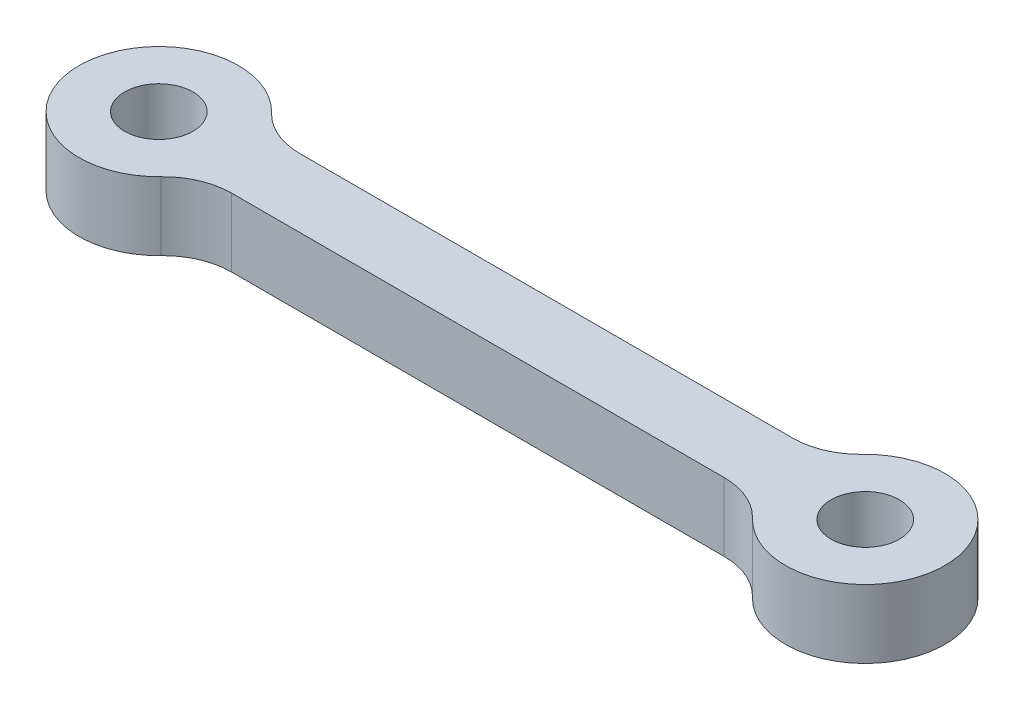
from build123d import *

# Parameters (mm, degrees)
SKETCH1_R           = 1.5
BOSS_EXTRUDE1_DEPTH = 3
FILLET1_R           = 3


with BuildPart() as part:
    # Sketch1 → Boss-Extrude1 (new body)
    with BuildSketch(Plane(origin=(0, 0, 0), x_dir=(1, 0, 0), z_dir=(0, 1, 0))):
        with BuildLine():
            ThreePointArc((3.16227766, 1.5), (-3.5, 0), (3.16227766, -1.5))
            Line((3.16227766, -1.5), (27.83772234, -1.5))
            ThreePointArc((27.83772234, -1.5), (34.5, 0), (27.83772234, 1.5))
            Line((27.83772234, 1.5), (3.16227766, 1.5))
        make_face()
        with Locations(Location((0, 0, 0), (0, 0, 270))):
            Circle(SKETCH1_R, mode=Mode.SUBTRACT)
        with Locations(Location((31, 0, 0), (0, 0, 270))):
            Circle(SKETCH1_R, mode=Mode.SUBTRACT)
    extrude(amount=BOSS_EXTRUDE1_DEPTH)

    # Fillet1
    fillet1_edges = [part.edges().sort_by_distance(p)[0] for p in [
        (27.83772234, 1.5, 1.5),
        (3.16227766, 1.5, 1.5),
        (3.16227766, 1.5, -1.5),
        (27.83772234, 1.5, -1.5),
    ]]
    fillet(fillet1_edges, radius=FILLET1_R)


solid = part.part
